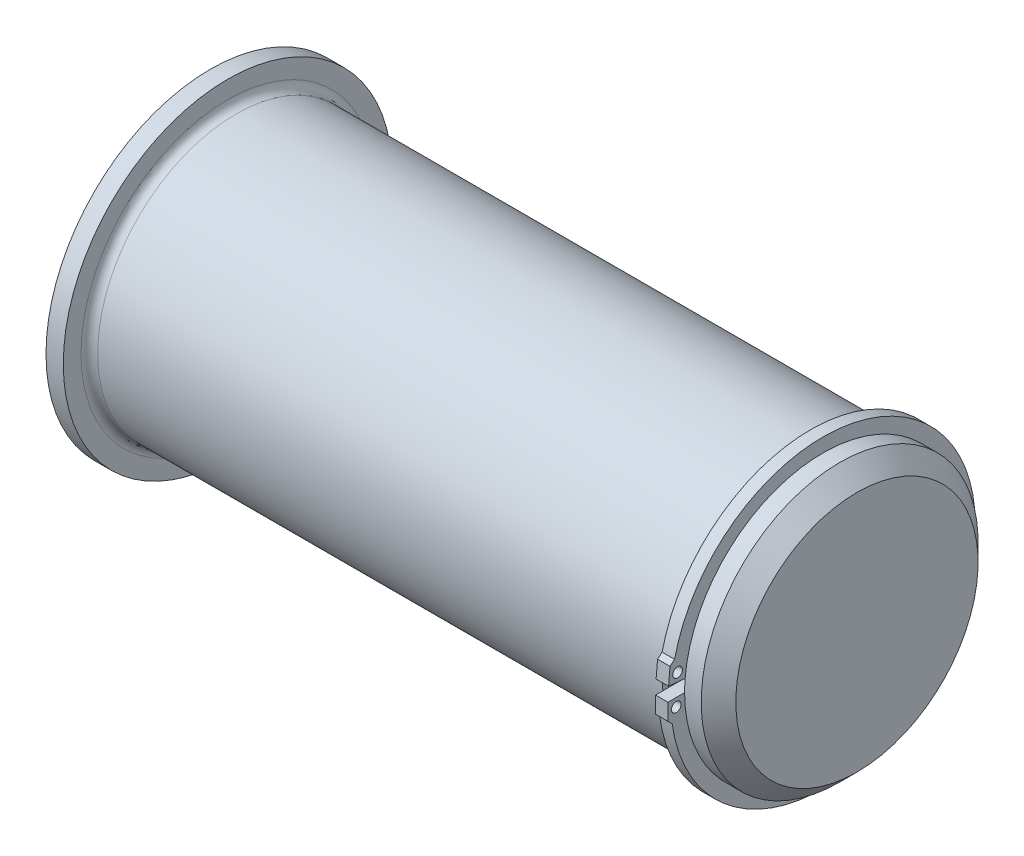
ISO-10303-21;
HEADER;
FILE_DESCRIPTION(('STEP AP214'),'2;1');
FILE_NAME('part.step','',(''),(''),'','','');
FILE_SCHEMA(('AUTOMOTIVE_DESIGN { 1 0 10303 214 1 1 1 1 }'));
ENDSEC;
DATA;
#1=APPLICATION_CONTEXT('core data for automotive mechanical design processes');
#2=APPLICATION_PROTOCOL_DEFINITION('international standard','automotive_design',2000,#1);
#3=PRODUCT_CONTEXT('',#1,'mechanical');
#4=PRODUCT('Part','Part','',(#3));
#5=PRODUCT_RELATED_PRODUCT_CATEGORY('part','',(#4));
#6=PRODUCT_DEFINITION_FORMATION('','',#4);
#7=PRODUCT_DEFINITION_CONTEXT('part definition',#1,'design');
#8=PRODUCT_DEFINITION('design','',#6,#7);
#9=PRODUCT_DEFINITION_SHAPE('','',#8);
#10=(LENGTH_UNIT() NAMED_UNIT(*) SI_UNIT(.MILLI.,.METRE.));
#11=(NAMED_UNIT(*) PLANE_ANGLE_UNIT() SI_UNIT($,.RADIAN.));
#12=(NAMED_UNIT(*) SI_UNIT($,.STERADIAN.) SOLID_ANGLE_UNIT());
#13=UNCERTAINTY_MEASURE_WITH_UNIT(LENGTH_MEASURE(1.E-05),#10,'distance_accuracy_value','');
#14=(GEOMETRIC_REPRESENTATION_CONTEXT(3) GLOBAL_UNCERTAINTY_ASSIGNED_CONTEXT((#13)) GLOBAL_UNIT_ASSIGNED_CONTEXT((#10,
#11,#12)) REPRESENTATION_CONTEXT('',''));
#15=CARTESIAN_POINT('',(0.,0.,0.));
#16=DIRECTION('',(0.,0.,1.));
#17=DIRECTION('',(1.,0.,0.));
#18=AXIS2_PLACEMENT_3D('',#15,#16,#17);
#19=CARTESIAN_POINT('',(0.,0.,0.));
#20=DIRECTION('',(-1.,0.,0.));
#21=DIRECTION('',(0.,-1.,0.));
#22=AXIS2_PLACEMENT_3D('',#19,#20,#21);
#23=CYLINDRICAL_SURFACE('',#22,11.049);
#24=CARTESIAN_POINT('',(50.8,0.,0.));
#25=DIRECTION('',(-1.,0.,0.));
#26=DIRECTION('',(0.,-1.,0.));
#27=AXIS2_PLACEMENT_3D('',#24,#25,#26);
#28=CIRCLE('',#27,11.049);
#29=CARTESIAN_POINT('',(50.8,-11.049,0.));
#30=VERTEX_POINT('',#29);
#31=EDGE_CURVE('E186',#30,#30,#28,.T.);
#32=ORIENTED_EDGE('',*,*,#31,.F.);
#33=EDGE_LOOP('',(#32));
#34=FACE_BOUND('',#33,.T.);
#35=DIRECTION('',(1.,0.,0.));
#36=VECTOR('',#35,1.);
#37=CARTESIAN_POINT('',(51.689,0.962983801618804,11.0069552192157));
#38=LINE('',#37,#36);
#39=CARTESIAN_POINT('',(51.689,0.962983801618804,11.0069552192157));
#40=VERTEX_POINT('',#39);
#41=CARTESIAN_POINT('',(52.832,0.962983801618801,11.0069552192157));
#42=VERTEX_POINT('',#41);
#43=EDGE_CURVE('E53',#40,#42,#38,.T.);
#44=ORIENTED_EDGE('',*,*,#43,.F.);
#45=CARTESIAN_POINT('',(51.689,0.,0.));
#46=DIRECTION('',(1.,0.,0.));
#47=DIRECTION('',(0.,0.,1.));
#48=AXIS2_PLACEMENT_3D('',#45,#46,#47);
#49=CIRCLE('',#48,11.049);
#50=CARTESIAN_POINT('',(51.689,0.,11.049));
#51=VERTEX_POINT('',#50);
#52=EDGE_CURVE('E58',#51,#40,#49,.T.);
#53=ORIENTED_EDGE('',*,*,#52,.F.);
#54=DIRECTION('',(1.,0.,0.));
#55=VECTOR('',#54,1.);
#56=CARTESIAN_POINT('',(51.689,0.,11.049));
#57=LINE('',#56,#55);
#58=CARTESIAN_POINT('',(52.832,0.,11.049));
#59=VERTEX_POINT('',#58);
#60=EDGE_CURVE('E142',#51,#59,#57,.T.);
#61=ORIENTED_EDGE('',*,*,#60,.T.);
#62=CARTESIAN_POINT('',(52.832,0.,0.));
#63=DIRECTION('',(-1.,0.,0.));
#64=DIRECTION('',(0.,-1.,0.));
#65=AXIS2_PLACEMENT_3D('',#62,#63,#64);
#66=CIRCLE('',#65,11.049);
#67=EDGE_CURVE('E184',#59,#42,#66,.T.);
#68=ORIENTED_EDGE('',*,*,#67,.T.);
#69=EDGE_LOOP('',(#44,#53,#61,#68));
#70=FACE_BOUND('',#69,.T.);
#71=ADVANCED_FACE('F38',(#34,#70),#23,.T.);
#72=CARTESIAN_POINT('',(52.832,11.049,0.));
#73=DIRECTION('',(1.,0.,0.));
#74=DIRECTION('',(0.,1.,0.));
#75=AXIS2_PLACEMENT_3D('',#72,#73,#74);
#76=PLANE('',#75);
#77=DIRECTION('',(0.,0.0871557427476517,0.996194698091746));
#78=VECTOR('',#77,1.);
#79=CARTESIAN_POINT('',(52.832,0.962983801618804,11.0069552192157));
#80=LINE('',#79,#78);
#81=CARTESIAN_POINT('',(52.832,1.10687793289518,12.6516726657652));
#82=VERTEX_POINT('',#81);
#83=EDGE_CURVE('E143',#42,#82,#80,.T.);
#84=ORIENTED_EDGE('',*,*,#83,.F.);
#85=ORIENTED_EDGE('',*,*,#67,.F.);
#86=DIRECTION('',(0.,0.,-1.));
#87=VECTOR('',#86,1.);
#88=CARTESIAN_POINT('',(52.832,0.,11.049));
#89=LINE('',#88,#87);
#90=CARTESIAN_POINT('',(52.832,0.,12.7));
#91=VERTEX_POINT('',#90);
#92=EDGE_CURVE('E155',#91,#59,#89,.T.);
#93=ORIENTED_EDGE('',*,*,#92,.F.);
#94=CARTESIAN_POINT('',(52.832,0.,0.));
#95=DIRECTION('',(-1.,0.,0.));
#96=DIRECTION('',(0.,-1.,0.));
#97=AXIS2_PLACEMENT_3D('',#94,#95,#96);
#98=CIRCLE('',#97,12.7);
#99=EDGE_CURVE('E181',#91,#82,#98,.T.);
#100=ORIENTED_EDGE('',*,*,#99,.T.);
#101=EDGE_LOOP('',(#84,#85,#93,#100));
#102=FACE_BOUND('',#101,.T.);
#103=ADVANCED_FACE('F228',(#102),#76,.F.);
#104=CARTESIAN_POINT('',(-3.3655,15.0876,0.));
#105=DIRECTION('',(1.,0.,0.));
#106=DIRECTION('',(0.,1.,0.));
#107=AXIS2_PLACEMENT_3D('',#104,#105,#106);
#108=PLANE('',#107);
#109=CARTESIAN_POINT('',(-3.3655,0.,0.));
#110=DIRECTION('',(-1.,0.,0.));
#111=DIRECTION('',(0.,-1.,0.));
#112=AXIS2_PLACEMENT_3D('',#109,#110,#111);
#113=CIRCLE('',#112,15.0876);
#114=CARTESIAN_POINT('',(-3.3655,-15.0876,0.));
#115=VERTEX_POINT('',#114);
#116=EDGE_CURVE('E11',#115,#115,#113,.T.);
#117=ORIENTED_EDGE('',*,*,#116,.T.);
#118=EDGE_LOOP('',(#117));
#119=FACE_BOUND('',#118,.T.);
#120=ADVANCED_FACE('F40',(#119),#108,.F.);
#121=CARTESIAN_POINT('',(0.,0.,0.));
#122=DIRECTION('',(-1.,0.,0.));
#123=DIRECTION('',(0.,-1.,0.));
#124=AXIS2_PLACEMENT_3D('',#121,#122,#123);
#125=CYLINDRICAL_SURFACE('',#124,15.0876);
#126=ORIENTED_EDGE('',*,*,#116,.F.);
#127=EDGE_LOOP('',(#126));
#128=FACE_BOUND('',#127,.T.);
#129=CARTESIAN_POINT('',(-1.778,0.,0.));
#130=DIRECTION('',(-1.,0.,0.));
#131=DIRECTION('',(0.,-1.,0.));
#132=AXIS2_PLACEMENT_3D('',#129,#130,#131);
#133=CIRCLE('',#132,15.0876);
#134=CARTESIAN_POINT('',(-1.778,-15.0876,0.));
#135=VERTEX_POINT('',#134);
#136=EDGE_CURVE('E46',#135,#135,#133,.T.);
#137=ORIENTED_EDGE('',*,*,#136,.T.);
#138=EDGE_LOOP('',(#137));
#139=FACE_BOUND('',#138,.T.);
#140=ADVANCED_FACE('F200',(#128,#139),#125,.T.);
#141=CARTESIAN_POINT('',(-1.778,13.462,0.));
#142=DIRECTION('',(-1.,0.,0.));
#143=DIRECTION('',(0.,-1.,0.));
#144=AXIS2_PLACEMENT_3D('',#141,#142,#143);
#145=PLANE('',#144);
#146=ORIENTED_EDGE('',*,*,#136,.F.);
#147=EDGE_LOOP('',(#146));
#148=FACE_BOUND('',#147,.T.);
#149=CARTESIAN_POINT('',(-1.778,0.,0.));
#150=DIRECTION('',(-1.,0.,0.));
#151=DIRECTION('',(0.,-1.,0.));
#152=AXIS2_PLACEMENT_3D('',#149,#150,#151);
#153=CIRCLE('',#152,13.462);
#154=CARTESIAN_POINT('',(-1.778,-13.462,0.));
#155=VERTEX_POINT('',#154);
#156=EDGE_CURVE('E195',#155,#155,#153,.T.);
#157=ORIENTED_EDGE('',*,*,#156,.T.);
#158=EDGE_LOOP('',(#157));
#159=FACE_BOUND('',#158,.T.);
#160=ADVANCED_FACE('F202',(#148,#159),#145,.F.);
#161=CARTESIAN_POINT('',(-1.016,0.,0.));
#162=DIRECTION('',(-1.,0.,0.));
#163=DIRECTION('',(0.,-1.,0.));
#164=AXIS2_PLACEMENT_3D('',#161,#162,#163);
#165=TOROIDAL_SURFACE('',#164,13.462,0.762);
#166=ORIENTED_EDGE('',*,*,#156,.F.);
#167=EDGE_LOOP('',(#166));
#168=FACE_BOUND('',#167,.T.);
#169=CARTESIAN_POINT('',(-1.01599999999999,0.,0.));
#170=DIRECTION('',(-1.,0.,0.));
#171=DIRECTION('',(0.,-1.,0.));
#172=AXIS2_PLACEMENT_3D('',#169,#170,#171);
#173=CIRCLE('',#172,12.7);
#174=CARTESIAN_POINT('',(-1.01599999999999,-12.7,0.));
#175=VERTEX_POINT('',#174);
#176=EDGE_CURVE('E192',#175,#175,#173,.T.);
#177=ORIENTED_EDGE('',*,*,#176,.T.);
#178=EDGE_LOOP('',(#177));
#179=FACE_BOUND('',#178,.T.);
#180=ADVANCED_FACE('F205',(#168,#179),#165,.F.);
#181=CARTESIAN_POINT('',(0.,0.,0.));
#182=DIRECTION('',(-1.,0.,0.));
#183=DIRECTION('',(0.,-1.,0.));
#184=AXIS2_PLACEMENT_3D('',#181,#182,#183);
#185=CYLINDRICAL_SURFACE('',#184,12.7);
#186=ORIENTED_EDGE('',*,*,#176,.F.);
#187=EDGE_LOOP('',(#186));
#188=FACE_BOUND('',#187,.T.);
#189=CARTESIAN_POINT('',(50.8,0.,0.));
#190=DIRECTION('',(-1.,0.,0.));
#191=DIRECTION('',(0.,-1.,0.));
#192=AXIS2_PLACEMENT_3D('',#189,#190,#191);
#193=CIRCLE('',#192,12.7);
#194=CARTESIAN_POINT('',(50.8,-12.7,0.));
#195=VERTEX_POINT('',#194);
#196=EDGE_CURVE('E189',#195,#195,#193,.T.);
#197=ORIENTED_EDGE('',*,*,#196,.T.);
#198=EDGE_LOOP('',(#197));
#199=FACE_BOUND('',#198,.T.);
#200=ADVANCED_FACE('F211',(#188,#199),#185,.T.);
#201=CARTESIAN_POINT('',(50.8,12.7,0.));
#202=DIRECTION('',(-1.,0.,0.));
#203=DIRECTION('',(0.,-1.,0.));
#204=AXIS2_PLACEMENT_3D('',#201,#202,#203);
#205=PLANE('',#204);
#206=ORIENTED_EDGE('',*,*,#196,.F.);
#207=EDGE_LOOP('',(#206));
#208=FACE_BOUND('',#207,.T.);
#209=ORIENTED_EDGE('',*,*,#31,.T.);
#210=EDGE_LOOP('',(#209));
#211=FACE_BOUND('',#210,.T.);
#212=ADVANCED_FACE('F217',(#208,#211),#205,.F.);
#213=CARTESIAN_POINT('',(0.,0.,0.));
#214=DIRECTION('',(-1.,0.,0.));
#215=DIRECTION('',(0.,-1.,0.));
#216=AXIS2_PLACEMENT_3D('',#213,#214,#215);
#217=CYLINDRICAL_SURFACE('',#216,12.7);
#218=ORIENTED_EDGE('',*,*,#99,.F.);
#219=EDGE_CURVE('E180',#82,#91,#98,.T.);
#220=ORIENTED_EDGE('',*,*,#219,.F.);
#221=EDGE_LOOP('',(#218,#220));
#222=FACE_BOUND('',#221,.T.);
#223=CARTESIAN_POINT('',(54.356,0.,0.));
#224=DIRECTION('',(-1.,0.,0.));
#225=DIRECTION('',(0.,-1.,0.));
#226=AXIS2_PLACEMENT_3D('',#223,#224,#225);
#227=CIRCLE('',#226,12.7);
#228=CARTESIAN_POINT('',(54.356,-12.7,0.));
#229=VERTEX_POINT('',#228);
#230=EDGE_CURVE('E177',#229,#229,#227,.T.);
#231=ORIENTED_EDGE('',*,*,#230,.T.);
#232=EDGE_LOOP('',(#231));
#233=FACE_BOUND('',#232,.T.);
#234=ADVANCED_FACE('F223',(#222,#233),#217,.T.);
#235=CARTESIAN_POINT('',(55.9435,0.,0.));
#236=DIRECTION('',(-1.,0.,0.));
#237=DIRECTION('',(0.,-1.,0.));
#238=AXIS2_PLACEMENT_3D('',#235,#236,#237);
#239=CONICAL_SURFACE('',#238,11.1125,0.785398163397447);
#240=ORIENTED_EDGE('',*,*,#230,.F.);
#241=EDGE_LOOP('',(#240));
#242=FACE_BOUND('',#241,.T.);
#243=CARTESIAN_POINT('',(55.9435,0.,0.));
#244=DIRECTION('',(-1.,0.,0.));
#245=DIRECTION('',(0.,-1.,0.));
#246=AXIS2_PLACEMENT_3D('',#243,#244,#245);
#247=CIRCLE('',#246,11.1125);
#248=CARTESIAN_POINT('',(55.9435,-11.1125,0.));
#249=VERTEX_POINT('',#248);
#250=EDGE_CURVE('E174',#249,#249,#247,.T.);
#251=ORIENTED_EDGE('',*,*,#250,.T.);
#252=EDGE_LOOP('',(#251));
#253=FACE_BOUND('',#252,.T.);
#254=ADVANCED_FACE('F262',(#242,#253),#239,.T.);
#255=CARTESIAN_POINT('',(55.9435,11.1125,0.));
#256=DIRECTION('',(-1.,0.,0.));
#257=DIRECTION('',(0.,-1.,0.));
#258=AXIS2_PLACEMENT_3D('',#255,#256,#257);
#259=PLANE('',#258);
#260=ORIENTED_EDGE('',*,*,#250,.F.);
#261=EDGE_LOOP('',(#260));
#262=FACE_BOUND('',#261,.T.);
#263=ADVANCED_FACE('F275',(#262),#259,.F.);
#264=CARTESIAN_POINT('',(51.689,0.,0.));
#265=DIRECTION('',(-1.,0.,0.));
#266=DIRECTION('',(0.,0.,1.));
#267=AXIS2_PLACEMENT_3D('',#264,#265,#266);
#268=PLANE('',#267);
#269=CARTESIAN_POINT('',(51.689,1.9323909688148,13.3443603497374));
#270=DIRECTION('',(-1.,0.,0.));
#271=DIRECTION('',(0.,0.,1.));
#272=AXIS2_PLACEMENT_3D('',#269,#270,#271);
#273=CIRCLE('',#272,0.4445);
#274=CARTESIAN_POINT('',(51.689,1.9323909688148,13.7888603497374));
#275=VERTEX_POINT('',#274);
#276=EDGE_CURVE('E437',#275,#275,#273,.T.);
#277=ORIENTED_EDGE('',*,*,#276,.F.);
#278=EDGE_LOOP('',(#277));
#279=FACE_BOUND('',#278,.T.);
#280=ORIENTED_EDGE('',*,*,#52,.T.);
#281=DIRECTION('',(0.,0.0871557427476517,0.996194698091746));
#282=VECTOR('',#281,1.);
#283=CARTESIAN_POINT('',(51.689,0.962983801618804,11.0069552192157));
#284=LINE('',#283,#282);
#285=CARTESIAN_POINT('',(51.689,1.2397032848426,14.169873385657));
#286=VERTEX_POINT('',#285);
#287=EDGE_CURVE('E107',#40,#286,#284,.T.);
#288=ORIENTED_EDGE('',*,*,#287,.T.);
#289=DIRECTION('',(0.,0.996194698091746,-0.0871557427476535));
#290=VECTOR('',#289,1.);
#291=CARTESIAN_POINT('',(51.689,1.2397032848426,14.169873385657));
#292=LINE('',#291,#290);
#293=CARTESIAN_POINT('',(51.689,2.75790400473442,14.0370480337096));
#294=VERTEX_POINT('',#293);
#295=EDGE_CURVE('E112',#286,#294,#292,.T.);
#296=ORIENTED_EDGE('',*,*,#295,.T.);
#297=DIRECTION('',(0.,0.642787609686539,-0.766044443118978));
#298=VECTOR('',#297,1.);
#299=CARTESIAN_POINT('',(51.689,2.75790400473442,14.0370480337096));
#300=LINE('',#299,#298);
#301=CARTESIAN_POINT('',(51.689,3.107933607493,13.6198989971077));
#302=VERTEX_POINT('',#301);
#303=EDGE_CURVE('E129',#294,#302,#300,.T.);
#304=ORIENTED_EDGE('',*,*,#303,.T.);
#305=CARTESIAN_POINT('',(51.689,0.,0.));
#306=DIRECTION('',(-1.,0.,0.));
#307=DIRECTION('',(0.,0.,1.));
#308=AXIS2_PLACEMENT_3D('',#305,#306,#307);
#309=CIRCLE('',#308,13.97);
#310=CARTESIAN_POINT('',(51.689,-1.90905456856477,13.8389454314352));
#311=VERTEX_POINT('',#310);
#312=EDGE_CURVE('E131',#302,#311,#309,.T.);
#313=ORIENTED_EDGE('',*,*,#312,.T.);
#314=DIRECTION('',(0.,0.707106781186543,0.707106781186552));
#315=VECTOR('',#314,1.);
#316=CARTESIAN_POINT('',(51.689,-1.524,14.224));
#317=LINE('',#316,#315);
#318=CARTESIAN_POINT('',(51.689,-1.524,14.224));
#319=VERTEX_POINT('',#318);
#320=EDGE_CURVE('E136',#311,#319,#317,.T.);
#321=ORIENTED_EDGE('',*,*,#320,.T.);
#322=DIRECTION('',(0.,1.,0.));
#323=VECTOR('',#322,1.);
#324=CARTESIAN_POINT('',(51.689,0.,14.224));
#325=LINE('',#324,#323);
#326=CARTESIAN_POINT('',(51.689,0.,14.224));
#327=VERTEX_POINT('',#326);
#328=EDGE_CURVE('E138',#319,#327,#325,.T.);
#329=ORIENTED_EDGE('',*,*,#328,.T.);
#330=DIRECTION('',(0.,0.,-1.));
#331=VECTOR('',#330,1.);
#332=CARTESIAN_POINT('',(51.689,0.,11.049));
#333=LINE('',#332,#331);
#334=EDGE_CURVE('E140',#327,#51,#333,.T.);
#335=ORIENTED_EDGE('',*,*,#334,.T.);
#336=EDGE_LOOP('',(#280,#288,#296,#304,#313,#321,#329,#335));
#337=FACE_BOUND('',#336,.T.);
#338=CARTESIAN_POINT('',(51.689,-0.762,13.462));
#339=DIRECTION('',(-1.,0.,0.));
#340=DIRECTION('',(0.,0.,1.));
#341=AXIS2_PLACEMENT_3D('',#338,#339,#340);
#342=CIRCLE('',#341,0.4445);
#343=CARTESIAN_POINT('',(51.689,-0.762,13.9065));
#344=VERTEX_POINT('',#343);
#345=EDGE_CURVE('E428',#344,#344,#342,.T.);
#346=ORIENTED_EDGE('',*,*,#345,.F.);
#347=EDGE_LOOP('',(#346));
#348=FACE_BOUND('',#347,.T.);
#349=ADVANCED_FACE('F109',(#279,#337,#348),#268,.T.);
#350=CARTESIAN_POINT('',(52.832,0.,0.));
#351=DIRECTION('',(-1.,0.,0.));
#352=DIRECTION('',(0.,0.,1.));
#353=AXIS2_PLACEMENT_3D('',#350,#351,#352);
#354=PLANE('',#353);
#355=CARTESIAN_POINT('',(52.832,1.2397032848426,14.169873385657));
#356=VERTEX_POINT('',#355);
#357=EDGE_CURVE('E121',#82,#356,#80,.T.);
#358=ORIENTED_EDGE('',*,*,#357,.F.);
#359=ORIENTED_EDGE('',*,*,#219,.T.);
#360=CARTESIAN_POINT('',(52.832,0.,14.224));
#361=VERTEX_POINT('',#360);
#362=EDGE_CURVE('E156',#361,#91,#89,.T.);
#363=ORIENTED_EDGE('',*,*,#362,.F.);
#364=DIRECTION('',(0.,1.,0.));
#365=VECTOR('',#364,1.);
#366=CARTESIAN_POINT('',(52.832,0.,14.224));
#367=LINE('',#366,#365);
#368=CARTESIAN_POINT('',(52.832,-1.524,14.224));
#369=VERTEX_POINT('',#368);
#370=EDGE_CURVE('E153',#369,#361,#367,.T.);
#371=ORIENTED_EDGE('',*,*,#370,.F.);
#372=DIRECTION('',(0.,0.707106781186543,0.707106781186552));
#373=VECTOR('',#372,1.);
#374=CARTESIAN_POINT('',(52.832,-1.524,14.224));
#375=LINE('',#374,#373);
#376=CARTESIAN_POINT('',(52.832,-1.90905456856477,13.8389454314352));
#377=VERTEX_POINT('',#376);
#378=EDGE_CURVE('E151',#377,#369,#375,.T.);
#379=ORIENTED_EDGE('',*,*,#378,.F.);
#380=CARTESIAN_POINT('',(52.832,0.,0.));
#381=DIRECTION('',(-1.,0.,0.));
#382=DIRECTION('',(0.,0.,1.));
#383=AXIS2_PLACEMENT_3D('',#380,#381,#382);
#384=CIRCLE('',#383,13.97);
#385=CARTESIAN_POINT('',(52.832,3.107933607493,13.6198989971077));
#386=VERTEX_POINT('',#385);
#387=EDGE_CURVE('E149',#386,#377,#384,.T.);
#388=ORIENTED_EDGE('',*,*,#387,.F.);
#389=DIRECTION('',(0.,0.642787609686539,-0.766044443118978));
#390=VECTOR('',#389,1.);
#391=CARTESIAN_POINT('',(52.832,2.75790400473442,14.0370480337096));
#392=LINE('',#391,#390);
#393=CARTESIAN_POINT('',(52.832,2.75790400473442,14.0370480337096));
#394=VERTEX_POINT('',#393);
#395=EDGE_CURVE('E147',#394,#386,#392,.T.);
#396=ORIENTED_EDGE('',*,*,#395,.F.);
#397=DIRECTION('',(0.,0.996194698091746,-0.0871557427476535));
#398=VECTOR('',#397,1.);
#399=CARTESIAN_POINT('',(52.832,1.2397032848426,14.169873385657));
#400=LINE('',#399,#398);
#401=EDGE_CURVE('E145',#356,#394,#400,.T.);
#402=ORIENTED_EDGE('',*,*,#401,.F.);
#403=EDGE_LOOP('',(#358,#359,#363,#371,#379,#388,#396,#402));
#404=FACE_BOUND('',#403,.T.);
#405=CARTESIAN_POINT('',(52.832,1.9323909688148,13.3443603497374));
#406=DIRECTION('',(-1.,0.,0.));
#407=DIRECTION('',(0.,0.,1.));
#408=AXIS2_PLACEMENT_3D('',#405,#406,#407);
#409=CIRCLE('',#408,0.4445);
#410=CARTESIAN_POINT('',(52.832,1.9323909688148,13.7888603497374));
#411=VERTEX_POINT('',#410);
#412=EDGE_CURVE('E434',#411,#411,#409,.T.);
#413=ORIENTED_EDGE('',*,*,#412,.T.);
#414=EDGE_LOOP('',(#413));
#415=FACE_BOUND('',#414,.T.);
#416=CARTESIAN_POINT('',(52.832,-0.762,13.462));
#417=DIRECTION('',(-1.,0.,0.));
#418=DIRECTION('',(0.,0.,1.));
#419=AXIS2_PLACEMENT_3D('',#416,#417,#418);
#420=CIRCLE('',#419,0.4445);
#421=CARTESIAN_POINT('',(52.832,-0.762,13.9065));
#422=VERTEX_POINT('',#421);
#423=EDGE_CURVE('E431',#422,#422,#420,.T.);
#424=ORIENTED_EDGE('',*,*,#423,.T.);
#425=EDGE_LOOP('',(#424));
#426=FACE_BOUND('',#425,.T.);
#427=ADVANCED_FACE('F274',(#404,#415,#426),#354,.F.);
#428=CARTESIAN_POINT('',(51.689,0.962983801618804,11.0069552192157));
#429=DIRECTION('',(0.,0.996194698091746,-0.0871557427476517));
#430=DIRECTION('',(0.,0.0871557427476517,0.996194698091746));
#431=AXIS2_PLACEMENT_3D('',#428,#429,#430);
#432=PLANE('',#431);
#433=ORIENTED_EDGE('',*,*,#83,.T.);
#434=ORIENTED_EDGE('',*,*,#357,.T.);
#435=DIRECTION('',(1.,0.,0.));
#436=VECTOR('',#435,1.);
#437=CARTESIAN_POINT('',(51.689,1.2397032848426,14.169873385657));
#438=LINE('',#437,#436);
#439=EDGE_CURVE('E117',#286,#356,#438,.T.);
#440=ORIENTED_EDGE('',*,*,#439,.F.);
#441=ORIENTED_EDGE('',*,*,#287,.F.);
#442=ORIENTED_EDGE('',*,*,#43,.T.);
#443=EDGE_LOOP('',(#433,#434,#440,#441,#442));
#444=FACE_BOUND('',#443,.T.);
#445=ADVANCED_FACE('F119',(#444),#432,.F.);
#446=CARTESIAN_POINT('',(51.689,1.2397032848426,14.169873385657));
#447=DIRECTION('',(0.,-0.0871557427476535,-0.996194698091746));
#448=DIRECTION('',(0.,0.996194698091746,-0.0871557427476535));
#449=AXIS2_PLACEMENT_3D('',#446,#447,#448);
#450=PLANE('',#449);
#451=ORIENTED_EDGE('',*,*,#401,.T.);
#452=DIRECTION('',(1.,0.,0.));
#453=VECTOR('',#452,1.);
#454=CARTESIAN_POINT('',(51.689,2.75790400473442,14.0370480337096));
#455=LINE('',#454,#453);
#456=EDGE_CURVE('E124',#294,#394,#455,.T.);
#457=ORIENTED_EDGE('',*,*,#456,.F.);
#458=ORIENTED_EDGE('',*,*,#295,.F.);
#459=ORIENTED_EDGE('',*,*,#439,.T.);
#460=EDGE_LOOP('',(#451,#457,#458,#459));
#461=FACE_BOUND('',#460,.T.);
#462=ADVANCED_FACE('F126',(#461),#450,.F.);
#463=CARTESIAN_POINT('',(51.689,2.75790400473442,14.0370480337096));
#464=DIRECTION('',(0.,-0.766044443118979,-0.642787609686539));
#465=DIRECTION('',(0.,0.642787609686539,-0.766044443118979));
#466=AXIS2_PLACEMENT_3D('',#463,#464,#465);
#467=PLANE('',#466);
#468=ORIENTED_EDGE('',*,*,#395,.T.);
#469=DIRECTION('',(1.,0.,0.));
#470=VECTOR('',#469,1.);
#471=CARTESIAN_POINT('',(51.689,3.107933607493,13.6198989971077));
#472=LINE('',#471,#470);
#473=EDGE_CURVE('E169',#302,#386,#472,.T.);
#474=ORIENTED_EDGE('',*,*,#473,.F.);
#475=ORIENTED_EDGE('',*,*,#303,.F.);
#476=ORIENTED_EDGE('',*,*,#456,.T.);
#477=EDGE_LOOP('',(#468,#474,#475,#476));
#478=FACE_BOUND('',#477,.T.);
#479=ADVANCED_FACE('F303',(#478),#467,.F.);
#480=CARTESIAN_POINT('',(51.689,0.,0.));
#481=DIRECTION('',(1.,0.,0.));
#482=DIRECTION('',(0.,0.,-1.));
#483=AXIS2_PLACEMENT_3D('',#480,#481,#482);
#484=CYLINDRICAL_SURFACE('',#483,13.97);
#485=ORIENTED_EDGE('',*,*,#387,.T.);
#486=DIRECTION('',(1.,0.,0.));
#487=VECTOR('',#486,1.);
#488=CARTESIAN_POINT('',(51.689,-1.90905456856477,13.8389454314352));
#489=LINE('',#488,#487);
#490=EDGE_CURVE('E166',#311,#377,#489,.T.);
#491=ORIENTED_EDGE('',*,*,#490,.F.);
#492=ORIENTED_EDGE('',*,*,#312,.F.);
#493=ORIENTED_EDGE('',*,*,#473,.T.);
#494=EDGE_LOOP('',(#485,#491,#492,#493));
#495=FACE_BOUND('',#494,.T.);
#496=ADVANCED_FACE('F312',(#495),#484,.T.);
#497=CARTESIAN_POINT('',(51.689,-1.524,14.224));
#498=DIRECTION('',(0.,0.707106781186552,-0.707106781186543));
#499=DIRECTION('',(0.,0.707106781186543,0.707106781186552));
#500=AXIS2_PLACEMENT_3D('',#497,#498,#499);
#501=PLANE('',#500);
#502=ORIENTED_EDGE('',*,*,#378,.T.);
#503=DIRECTION('',(1.,0.,0.));
#504=VECTOR('',#503,1.);
#505=CARTESIAN_POINT('',(51.689,-1.524,14.224));
#506=LINE('',#505,#504);
#507=EDGE_CURVE('E163',#319,#369,#506,.T.);
#508=ORIENTED_EDGE('',*,*,#507,.F.);
#509=ORIENTED_EDGE('',*,*,#320,.F.);
#510=ORIENTED_EDGE('',*,*,#490,.T.);
#511=EDGE_LOOP('',(#502,#508,#509,#510));
#512=FACE_BOUND('',#511,.T.);
#513=ADVANCED_FACE('F322',(#512),#501,.F.);
#514=CARTESIAN_POINT('',(51.689,0.,14.224));
#515=DIRECTION('',(0.,0.,-1.));
#516=DIRECTION('',(-1.,0.,0.));
#517=AXIS2_PLACEMENT_3D('',#514,#515,#516);
#518=PLANE('',#517);
#519=ORIENTED_EDGE('',*,*,#370,.T.);
#520=DIRECTION('',(1.,0.,0.));
#521=VECTOR('',#520,1.);
#522=CARTESIAN_POINT('',(51.689,0.,14.224));
#523=LINE('',#522,#521);
#524=EDGE_CURVE('E160',#327,#361,#523,.T.);
#525=ORIENTED_EDGE('',*,*,#524,.F.);
#526=ORIENTED_EDGE('',*,*,#328,.F.);
#527=ORIENTED_EDGE('',*,*,#507,.T.);
#528=EDGE_LOOP('',(#519,#525,#526,#527));
#529=FACE_BOUND('',#528,.T.);
#530=ADVANCED_FACE('F332',(#529),#518,.F.);
#531=CARTESIAN_POINT('',(51.689,0.,11.049));
#532=DIRECTION('',(0.,-1.,0.));
#533=DIRECTION('',(0.,0.,-1.));
#534=AXIS2_PLACEMENT_3D('',#531,#532,#533);
#535=PLANE('',#534);
#536=ORIENTED_EDGE('',*,*,#362,.T.);
#537=ORIENTED_EDGE('',*,*,#92,.T.);
#538=ORIENTED_EDGE('',*,*,#60,.F.);
#539=ORIENTED_EDGE('',*,*,#334,.F.);
#540=ORIENTED_EDGE('',*,*,#524,.T.);
#541=EDGE_LOOP('',(#536,#537,#538,#539,#540));
#542=FACE_BOUND('',#541,.T.);
#543=ADVANCED_FACE('F342',(#542),#535,.F.);
#544=CARTESIAN_POINT('',(51.689,1.9323909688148,13.3443603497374));
#545=DIRECTION('',(1.,0.,0.));
#546=DIRECTION('',(0.,0.,-1.));
#547=AXIS2_PLACEMENT_3D('',#544,#545,#546);
#548=CYLINDRICAL_SURFACE('',#547,0.4445);
#549=ORIENTED_EDGE('',*,*,#276,.T.);
#550=EDGE_LOOP('',(#549));
#551=FACE_BOUND('',#550,.T.);
#552=ORIENTED_EDGE('',*,*,#412,.F.);
#553=EDGE_LOOP('',(#552));
#554=FACE_BOUND('',#553,.T.);
#555=ADVANCED_FACE('F352',(#551,#554),#548,.F.);
#556=CARTESIAN_POINT('',(51.689,-0.762,13.462));
#557=DIRECTION('',(1.,0.,0.));
#558=DIRECTION('',(0.,0.,-1.));
#559=AXIS2_PLACEMENT_3D('',#556,#557,#558);
#560=CYLINDRICAL_SURFACE('',#559,0.4445);
#561=ORIENTED_EDGE('',*,*,#345,.T.);
#562=EDGE_LOOP('',(#561));
#563=FACE_BOUND('',#562,.T.);
#564=ORIENTED_EDGE('',*,*,#423,.F.);
#565=EDGE_LOOP('',(#564));
#566=FACE_BOUND('',#565,.T.);
#567=ADVANCED_FACE('F362',(#563,#566),#560,.F.);
#568=CLOSED_SHELL('',(#71,#103,#120,#140,#160,#180,#200,#212,#234,#254,#263,#349,#427,#445,#462,
#479,#496,#513,#530,#543,#555,#567));
#569=MANIFOLD_SOLID_BREP('B2',#568);
#570=ADVANCED_BREP_SHAPE_REPRESENTATION('',(#18,#569),#14);
#571=SHAPE_DEFINITION_REPRESENTATION(#9,#570);
ENDSEC;
END-ISO-10303-21;
